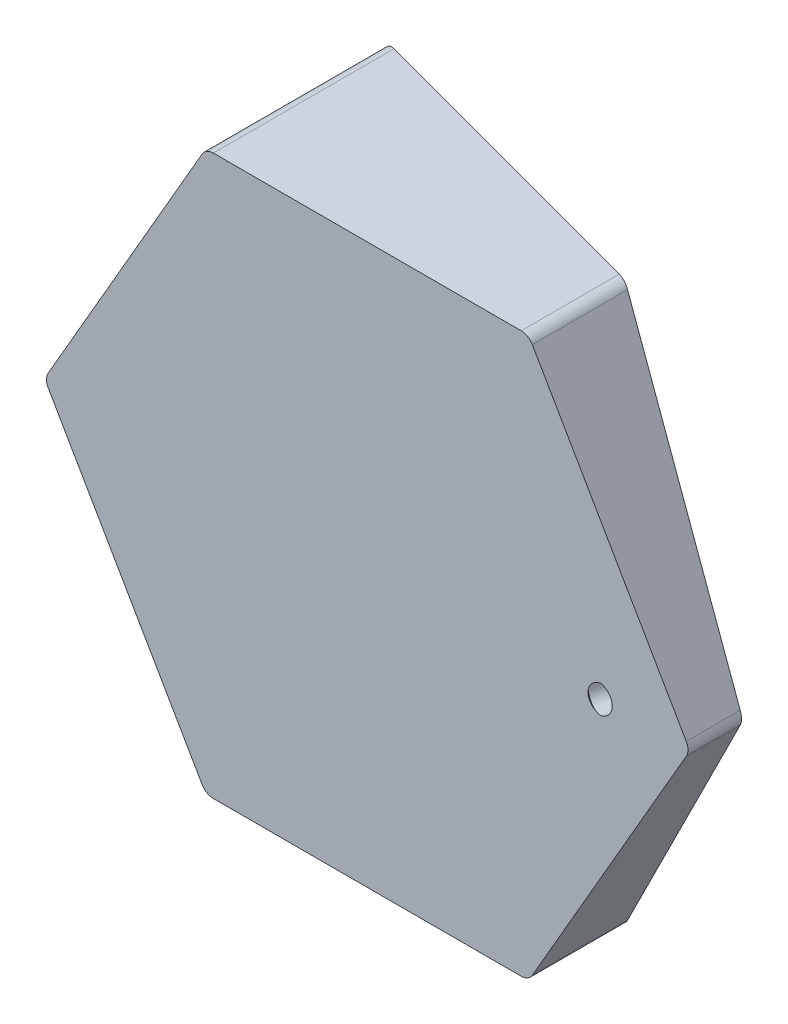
from build123d import *

# Parameters (mm, degrees)
BOSS_EXTRUDE1_DEPTH             = 35
CUT_EXTRUDE1_DEPTH              = 75.833147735
CUT_EXTRUDE1_DEPTH_BACK         = 75.833147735
SKETCH3_R                       = 17.5
CUT_EXTRUDE2_DEPTH              = 6
M4X0_7_TAPPED_HOLE1_D           = 3.3
M4X0_7_TAPPED_HOLE1_DEPTH       = 11.5
M4X0_7_TAPPED_HOLE1_CSINK_D     = 4.05
M4X0_7_TAPPED_HOLE1_CSINK_ANGLE = 90
M4X0_7_TAPPED_HOLE1_TIP         = 0.991420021
FILLET2_R                       = 2
CBORE_FOR_M4_SHCS1_AT_2_COUNT   = 2
CBORE_FOR_M4_SHCS1_AT_2_PITCH   = 53.150729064
CBORE_FOR_M4_SHCS1_AT_3_COUNT   = 2
CBORE_FOR_M4_SHCS1_AT_3_PITCH   = 53.150729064
CBORE_FOR_M4_SHCS1_AT_4_COUNT   = 2
CBORE_FOR_M4_SHCS1_AT_4_PITCH   = 75


with BuildPart() as part:
    # Sketch1 → Boss-Extrude1 (new body)
    with BuildSketch(Plane.XY):
        Polygon((50, 0), (25, 43.301270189), (-25, 43.301270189), (-50, 0), (-25, -43.301270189), (25, -43.301270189), align=None)
    extrude(amount=BOSS_EXTRUDE1_DEPTH)

    # Sketch2 → Cut-Extrude1 (cut, two sides: drawn at the far end of the back side and taken through both)
    with BuildSketch(Plane(origin=(0, 0, 0), x_dir=(1, 0, 0), z_dir=(0, 1, 0)).offset(-CUT_EXTRUDE1_DEPTH_BACK)):
        Polygon((-50, 0), (50, -26.794919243), (50, 0), align=None)
    extrude(amount=CUT_EXTRUDE1_DEPTH + CUT_EXTRUDE1_DEPTH_BACK, mode=Mode.SUBTRACT)

    # Sketch3 → Cut-Extrude2 (cut)
    with BuildSketch(Plane(origin=(-3.349364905, 0, 12.5), x_dir=(-0.96592582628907, 0, -0.2588190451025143), z_dir=(0.2588190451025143, 0, -0.96592582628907))):
        with Locations((-3.467517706, 0)):
            Circle(SKETCH3_R)
    extrude(amount=-CUT_EXTRUDE2_DEPTH, mode=Mode.SUBTRACT)

    # M4x0.7 Tapped Hole1
    with Locations(Plane(origin=(-3.349364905, 0, 12.5), x_dir=(-0.96592582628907, 0, -0.2588190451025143), z_dir=(0.2588190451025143, 0, -0.96592582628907))):
        with Locations((-3.467517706, 25), (14.210151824, 17.67766953), (21.532482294, 0), (14.210151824, -17.67766953), (-3.467517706, -25), (-21.145187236, -17.67766953), (-28.467517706, 0), (-21.145187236, 17.67766953)):
            CounterSinkHole(M4X0_7_TAPPED_HOLE1_D / 2, M4X0_7_TAPPED_HOLE1_CSINK_D / 2, depth=M4X0_7_TAPPED_HOLE1_DEPTH, counter_sink_angle=M4X0_7_TAPPED_HOLE1_CSINK_ANGLE)
            with Locations((0, 0, -(M4X0_7_TAPPED_HOLE1_DEPTH + M4X0_7_TAPPED_HOLE1_TIP / 2))):  # 118° drill point
                Cone(0, M4X0_7_TAPPED_HOLE1_D / 2, M4X0_7_TAPPED_HOLE1_TIP, mode=Mode.SUBTRACT)

    # Fillet2
    fillet2_edges = [part.edges().sort_by_distance(p)[0] for p in [
        (25, -43.301270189, 27.548094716),
        (-25, -43.301270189, 20.849364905),
        (-50, 0, 17.5),
        (-25, 43.301270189, 20.849364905),
        (25, 43.301270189, 27.548094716),
        (50, 0, 30.897459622),
    ]]
    fillet(fillet2_edges, radius=FILLET2_R)

    # Sketch9 → CBORE for M4 SHCS1 (revolve, cut)
    with BuildSketch(Plane(origin=(38.637033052, 0, 23.750221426), x_dir=(-0.96592582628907, 0, -0.2588190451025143), z_dir=(0, 1, 0))):
        Polygon((0, 0), (0, 12.851936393), (2.25, 11.5), (2.25, 4), (4, 4), (4, 0.025), (4.025, 0), align=None)
    cbore_for_m4_shcs1 = revolve(axis=Axis((40.280533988, 0, 17.616592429), (-0.2588190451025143, 0, 0.96592582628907)), mode=Mode.SUBTRACT)

    # CBORE for M4 SHCS1 at 2: CBORE for M4 SHCS1 ×2
    with Locations(*[Vector(-0.7269332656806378, 0.6585046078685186, -0.19478118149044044) * (i * CBORE_FOR_M4_SHCS1_AT_2_PITCH) for i in range(1, CBORE_FOR_M4_SHCS1_AT_2_COUNT)]):
        add(cbore_for_m4_shcs1, mode=Mode.SUBTRACT)

    # CBORE for M4 SHCS1 at 3: CBORE for M4 SHCS1 ×2
    with Locations(*[Vector(-0.7269332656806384, -0.6585046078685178, -0.19478118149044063) * (i * CBORE_FOR_M4_SHCS1_AT_3_PITCH) for i in range(1, CBORE_FOR_M4_SHCS1_AT_3_COUNT)]):
        add(cbore_for_m4_shcs1, mode=Mode.SUBTRACT)

    # CBORE for M4 SHCS1 at 4: CBORE for M4 SHCS1 ×2
    with Locations(*[Vector(-0.96592582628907, 0, -0.2588190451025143) * (i * CBORE_FOR_M4_SHCS1_AT_4_PITCH) for i in range(1, CBORE_FOR_M4_SHCS1_AT_4_COUNT)]):
        add(cbore_for_m4_shcs1, mode=Mode.SUBTRACT)


solid = part.part
